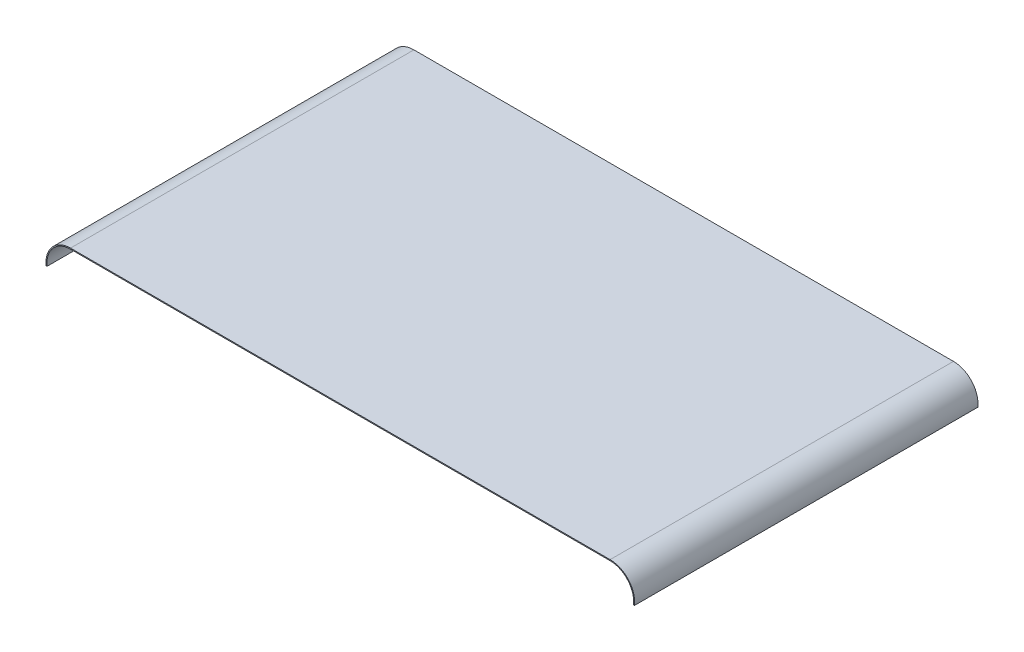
ISO-10303-21;
HEADER;
FILE_DESCRIPTION(('STEP AP214'),'2;1');
FILE_NAME('part.step','',(''),(''),'','','');
FILE_SCHEMA(('AUTOMOTIVE_DESIGN { 1 0 10303 214 1 1 1 1 }'));
ENDSEC;
DATA;
#1=APPLICATION_CONTEXT('core data for automotive mechanical design processes');
#2=APPLICATION_PROTOCOL_DEFINITION('international standard','automotive_design',2000,#1);
#3=PRODUCT_CONTEXT('',#1,'mechanical');
#4=PRODUCT('Part','Part','',(#3));
#5=PRODUCT_RELATED_PRODUCT_CATEGORY('part','',(#4));
#6=PRODUCT_DEFINITION_FORMATION('','',#4);
#7=PRODUCT_DEFINITION_CONTEXT('part definition',#1,'design');
#8=PRODUCT_DEFINITION('design','',#6,#7);
#9=PRODUCT_DEFINITION_SHAPE('','',#8);
#10=(LENGTH_UNIT() NAMED_UNIT(*) SI_UNIT(.MILLI.,.METRE.));
#11=(NAMED_UNIT(*) PLANE_ANGLE_UNIT() SI_UNIT($,.RADIAN.));
#12=(NAMED_UNIT(*) SI_UNIT($,.STERADIAN.) SOLID_ANGLE_UNIT());
#13=UNCERTAINTY_MEASURE_WITH_UNIT(LENGTH_MEASURE(1.E-05),#10,'distance_accuracy_value','');
#14=(GEOMETRIC_REPRESENTATION_CONTEXT(3) GLOBAL_UNCERTAINTY_ASSIGNED_CONTEXT((#13)) GLOBAL_UNIT_ASSIGNED_CONTEXT((#10,
#11,#12)) REPRESENTATION_CONTEXT('',''));
#15=CARTESIAN_POINT('',(0.,0.,0.));
#16=DIRECTION('',(0.,0.,1.));
#17=DIRECTION('',(1.,0.,0.));
#18=AXIS2_PLACEMENT_3D('',#15,#16,#17);
#19=CARTESIAN_POINT('',(-40.,-50.,0.));
#20=DIRECTION('',(0.,0.,-1.));
#21=DIRECTION('',(-1.,0.,0.));
#22=AXIS2_PLACEMENT_3D('',#19,#20,#21);
#23=PLANE('',#22);
#24=CARTESIAN_POINT('',(-40.,-50.,0.));
#25=DIRECTION('',(0.,0.,-1.));
#26=DIRECTION('',(-1.,0.,0.));
#27=AXIS2_PLACEMENT_3D('',#24,#25,#26);
#28=CIRCLE('',#27,48.);
#29=CARTESIAN_POINT('',(-40.,-2.,0.));
#30=VERTEX_POINT('',#29);
#31=CARTESIAN_POINT('',(-87.6309393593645,-55.9408430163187,0.));
#32=VERTEX_POINT('',#31);
#33=EDGE_CURVE('E147',#30,#32,#28,.F.);
#34=ORIENTED_EDGE('',*,*,#33,.F.);
#35=DIRECTION('',(1.,0.,0.));
#36=VECTOR('',#35,1.);
#37=CARTESIAN_POINT('',(-40.,-2.,0.));
#38=LINE('',#37,#36);
#39=CARTESIAN_POINT('',(1060.,-2.,0.));
#40=VERTEX_POINT('',#39);
#41=EDGE_CURVE('E156',#40,#30,#38,.F.);
#42=ORIENTED_EDGE('',*,*,#41,.F.);
#43=CARTESIAN_POINT('',(1060.,-50.,0.));
#44=DIRECTION('',(0.,0.,-1.));
#45=DIRECTION('',(-1.,0.,0.));
#46=AXIS2_PLACEMENT_3D('',#43,#44,#45);
#47=CIRCLE('',#46,47.9999999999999);
#48=CARTESIAN_POINT('',(1107.63093935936,-55.9408430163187,0.));
#49=VERTEX_POINT('',#48);
#50=EDGE_CURVE('E160',#49,#40,#47,.F.);
#51=ORIENTED_EDGE('',*,*,#50,.F.);
#52=DIRECTION('',(-0.992311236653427,0.123767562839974,0.));
#53=VECTOR('',#52,1.);
#54=CARTESIAN_POINT('',(1109.61556183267,-56.1883781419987,0.));
#55=LINE('',#54,#53);
#56=CARTESIAN_POINT('',(1109.61556183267,-56.1883781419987,0.));
#57=VERTEX_POINT('',#56);
#58=EDGE_CURVE('E11',#57,#49,#55,.T.);
#59=ORIENTED_EDGE('',*,*,#58,.F.);
#60=CARTESIAN_POINT('',(1060.,-50.,0.));
#61=DIRECTION('',(0.,0.,1.));
#62=DIRECTION('',(-1.,0.,0.));
#63=AXIS2_PLACEMENT_3D('',#60,#61,#62);
#64=CIRCLE('',#63,50.);
#65=CARTESIAN_POINT('',(1060.,0.,0.));
#66=VERTEX_POINT('',#65);
#67=EDGE_CURVE('E132',#57,#66,#64,.T.);
#68=ORIENTED_EDGE('',*,*,#67,.T.);
#69=DIRECTION('',(-1.,0.,0.));
#70=VECTOR('',#69,1.);
#71=CARTESIAN_POINT('',(-40.,0.,0.));
#72=LINE('',#71,#70);
#73=CARTESIAN_POINT('',(-40.,0.,0.));
#74=VERTEX_POINT('',#73);
#75=EDGE_CURVE('E133',#66,#74,#72,.T.);
#76=ORIENTED_EDGE('',*,*,#75,.T.);
#77=CARTESIAN_POINT('',(-40.,-50.,0.));
#78=DIRECTION('',(0.,0.,1.));
#79=DIRECTION('',(1.,0.,0.));
#80=AXIS2_PLACEMENT_3D('',#77,#78,#79);
#81=CIRCLE('',#80,50.);
#82=CARTESIAN_POINT('',(-89.6155618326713,-56.1883781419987,0.));
#83=VERTEX_POINT('',#82);
#84=EDGE_CURVE('E120',#74,#83,#81,.T.);
#85=ORIENTED_EDGE('',*,*,#84,.T.);
#86=DIRECTION('',(0.992311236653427,0.123767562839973,0.));
#87=VECTOR('',#86,1.);
#88=CARTESIAN_POINT('',(-89.6155618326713,-56.1883781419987,0.));
#89=LINE('',#88,#87);
#90=EDGE_CURVE('E48',#83,#32,#89,.T.);
#91=ORIENTED_EDGE('',*,*,#90,.T.);
#92=EDGE_LOOP('',(#34,#42,#51,#59,#68,#76,#85,#91));
#93=FACE_BOUND('',#92,.T.);
#94=ADVANCED_FACE('F38',(#93),#23,.F.);
#95=CARTESIAN_POINT('',(-89.6155618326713,-56.1883781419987,-350.));
#96=DIRECTION('',(-0.123767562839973,0.992311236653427,0.));
#97=DIRECTION('',(0.,0.,-1.));
#98=AXIS2_PLACEMENT_3D('',#95,#96,#97);
#99=PLANE('',#98);
#100=ORIENTED_EDGE('',*,*,#90,.F.);
#101=DIRECTION('',(0.,0.,-1.));
#102=VECTOR('',#101,1.);
#103=CARTESIAN_POINT('',(-89.6155618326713,-56.1883781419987,0.));
#104=LINE('',#103,#102);
#105=CARTESIAN_POINT('',(-89.6155618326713,-56.1883781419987,-700.));
#106=VERTEX_POINT('',#105);
#107=EDGE_CURVE('E116',#83,#106,#104,.T.);
#108=ORIENTED_EDGE('',*,*,#107,.T.);
#109=DIRECTION('',(0.992311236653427,0.123767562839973,0.));
#110=VECTOR('',#109,1.);
#111=CARTESIAN_POINT('',(-89.6155618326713,-56.1883781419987,-700.));
#112=LINE('',#111,#110);
#113=CARTESIAN_POINT('',(-87.6309393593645,-55.9408430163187,-700.));
#114=VERTEX_POINT('',#113);
#115=EDGE_CURVE('E101',#106,#114,#112,.T.);
#116=ORIENTED_EDGE('',*,*,#115,.T.);
#117=DIRECTION('',(0.,0.,-1.));
#118=VECTOR('',#117,1.);
#119=CARTESIAN_POINT('',(-87.6309393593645,-55.9408430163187,0.));
#120=LINE('',#119,#118);
#121=EDGE_CURVE('E153',#32,#114,#120,.T.);
#122=ORIENTED_EDGE('',*,*,#121,.F.);
#123=EDGE_LOOP('',(#100,#108,#116,#122));
#124=FACE_BOUND('',#123,.T.);
#125=ADVANCED_FACE('F118',(#124),#99,.F.);
#126=CARTESIAN_POINT('',(1060.,-50.,-700.));
#127=DIRECTION('',(0.,0.,-1.));
#128=DIRECTION('',(-1.,0.,0.));
#129=AXIS2_PLACEMENT_3D('',#126,#127,#128);
#130=PLANE('',#129);
#131=CARTESIAN_POINT('',(1060.,-50.,-700.));
#132=DIRECTION('',(0.,0.,-1.));
#133=DIRECTION('',(-1.,0.,0.));
#134=AXIS2_PLACEMENT_3D('',#131,#132,#133);
#135=CIRCLE('',#134,47.9999999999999);
#136=CARTESIAN_POINT('',(1107.63093935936,-55.9408430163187,-700.));
#137=VERTEX_POINT('',#136);
#138=CARTESIAN_POINT('',(1060.,-2.00000000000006,-700.));
#139=VERTEX_POINT('',#138);
#140=EDGE_CURVE('E158',#137,#139,#135,.F.);
#141=ORIENTED_EDGE('',*,*,#140,.T.);
#142=DIRECTION('',(1.,0.,0.));
#143=VECTOR('',#142,1.);
#144=CARTESIAN_POINT('',(-40.,-2.,-700.));
#145=LINE('',#144,#143);
#146=CARTESIAN_POINT('',(-40.,-2.,-700.));
#147=VERTEX_POINT('',#146);
#148=EDGE_CURVE('E151',#139,#147,#145,.F.);
#149=ORIENTED_EDGE('',*,*,#148,.T.);
#150=CARTESIAN_POINT('',(-40.,-50.,-700.));
#151=DIRECTION('',(0.,0.,-1.));
#152=DIRECTION('',(-1.,0.,0.));
#153=AXIS2_PLACEMENT_3D('',#150,#151,#152);
#154=CIRCLE('',#153,48.);
#155=EDGE_CURVE('E108',#147,#114,#154,.F.);
#156=ORIENTED_EDGE('',*,*,#155,.T.);
#157=ORIENTED_EDGE('',*,*,#115,.F.);
#158=CARTESIAN_POINT('',(-40.,-50.,-700.));
#159=DIRECTION('',(0.,0.,1.));
#160=DIRECTION('',(1.,0.,0.));
#161=AXIS2_PLACEMENT_3D('',#158,#159,#160);
#162=CIRCLE('',#161,50.);
#163=CARTESIAN_POINT('',(-40.,0.,-700.));
#164=VERTEX_POINT('',#163);
#165=EDGE_CURVE('E105',#164,#106,#162,.T.);
#166=ORIENTED_EDGE('',*,*,#165,.F.);
#167=DIRECTION('',(-1.,0.,0.));
#168=VECTOR('',#167,1.);
#169=CARTESIAN_POINT('',(-40.,0.,-700.));
#170=LINE('',#169,#168);
#171=CARTESIAN_POINT('',(1060.,0.,-700.));
#172=VERTEX_POINT('',#171);
#173=EDGE_CURVE('E119',#172,#164,#170,.T.);
#174=ORIENTED_EDGE('',*,*,#173,.F.);
#175=CARTESIAN_POINT('',(1060.,-50.,-700.));
#176=DIRECTION('',(0.,0.,1.));
#177=DIRECTION('',(-1.,0.,0.));
#178=AXIS2_PLACEMENT_3D('',#175,#176,#177);
#179=CIRCLE('',#178,50.);
#180=CARTESIAN_POINT('',(1109.61556183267,-56.1883781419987,-700.));
#181=VERTEX_POINT('',#180);
#182=EDGE_CURVE('E127',#181,#172,#179,.T.);
#183=ORIENTED_EDGE('',*,*,#182,.F.);
#184=DIRECTION('',(-0.992311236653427,0.123767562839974,0.));
#185=VECTOR('',#184,1.);
#186=CARTESIAN_POINT('',(1109.61556183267,-56.1883781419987,-700.));
#187=LINE('',#186,#185);
#188=EDGE_CURVE('E42',#181,#137,#187,.T.);
#189=ORIENTED_EDGE('',*,*,#188,.T.);
#190=EDGE_LOOP('',(#141,#149,#156,#157,#166,#174,#183,#189));
#191=FACE_BOUND('',#190,.T.);
#192=ADVANCED_FACE('F103',(#191),#130,.T.);
#193=CARTESIAN_POINT('',(1109.61556183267,-56.1883781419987,-350.));
#194=DIRECTION('',(-0.123767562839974,-0.992311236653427,0.));
#195=DIRECTION('',(0.,0.,-1.));
#196=AXIS2_PLACEMENT_3D('',#193,#194,#195);
#197=PLANE('',#196);
#198=DIRECTION('',(0.,0.,-1.));
#199=VECTOR('',#198,1.);
#200=CARTESIAN_POINT('',(1109.61556183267,-56.1883781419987,0.));
#201=LINE('',#200,#199);
#202=EDGE_CURVE('E129',#57,#181,#201,.T.);
#203=ORIENTED_EDGE('',*,*,#202,.F.);
#204=ORIENTED_EDGE('',*,*,#58,.T.);
#205=DIRECTION('',(0.,0.,-1.));
#206=VECTOR('',#205,1.);
#207=CARTESIAN_POINT('',(1107.63093935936,-55.9408430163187,0.));
#208=LINE('',#207,#206);
#209=EDGE_CURVE('E162',#49,#137,#208,.T.);
#210=ORIENTED_EDGE('',*,*,#209,.T.);
#211=ORIENTED_EDGE('',*,*,#188,.F.);
#212=EDGE_LOOP('',(#203,#204,#210,#211));
#213=FACE_BOUND('',#212,.T.);
#214=ADVANCED_FACE('F40',(#213),#197,.T.);
#215=CARTESIAN_POINT('',(1060.,-50.,0.));
#216=DIRECTION('',(0.,0.,-1.));
#217=DIRECTION('',(-1.,0.,0.));
#218=AXIS2_PLACEMENT_3D('',#215,#216,#217);
#219=CYLINDRICAL_SURFACE('',#218,47.9999999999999);
#220=ORIENTED_EDGE('',*,*,#140,.F.);
#221=ORIENTED_EDGE('',*,*,#209,.F.);
#222=ORIENTED_EDGE('',*,*,#50,.T.);
#223=DIRECTION('',(0.,0.,-1.));
#224=VECTOR('',#223,1.);
#225=CARTESIAN_POINT('',(1060.,-2.00000000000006,0.));
#226=LINE('',#225,#224);
#227=EDGE_CURVE('E159',#40,#139,#226,.T.);
#228=ORIENTED_EDGE('',*,*,#227,.T.);
#229=EDGE_LOOP('',(#220,#221,#222,#228));
#230=FACE_BOUND('',#229,.T.);
#231=ADVANCED_FACE('F178',(#230),#219,.F.);
#232=CARTESIAN_POINT('',(-40.,-2.,0.));
#233=DIRECTION('',(0.,-1.,0.));
#234=DIRECTION('',(0.,0.,-1.));
#235=AXIS2_PLACEMENT_3D('',#232,#233,#234);
#236=PLANE('',#235);
#237=ORIENTED_EDGE('',*,*,#148,.F.);
#238=ORIENTED_EDGE('',*,*,#227,.F.);
#239=ORIENTED_EDGE('',*,*,#41,.T.);
#240=DIRECTION('',(0.,0.,-1.));
#241=VECTOR('',#240,1.);
#242=CARTESIAN_POINT('',(-40.,-2.,0.));
#243=LINE('',#242,#241);
#244=EDGE_CURVE('E144',#30,#147,#243,.T.);
#245=ORIENTED_EDGE('',*,*,#244,.T.);
#246=EDGE_LOOP('',(#237,#238,#239,#245));
#247=FACE_BOUND('',#246,.T.);
#248=ADVANCED_FACE('F174',(#247),#236,.T.);
#249=CARTESIAN_POINT('',(-40.,-50.,0.));
#250=DIRECTION('',(0.,0.,-1.));
#251=DIRECTION('',(-1.,0.,0.));
#252=AXIS2_PLACEMENT_3D('',#249,#250,#251);
#253=CYLINDRICAL_SURFACE('',#252,48.);
#254=ORIENTED_EDGE('',*,*,#155,.F.);
#255=ORIENTED_EDGE('',*,*,#244,.F.);
#256=ORIENTED_EDGE('',*,*,#33,.T.);
#257=ORIENTED_EDGE('',*,*,#121,.T.);
#258=EDGE_LOOP('',(#254,#255,#256,#257));
#259=FACE_BOUND('',#258,.T.);
#260=ADVANCED_FACE('F176',(#259),#253,.F.);
#261=CARTESIAN_POINT('',(1060.,-50.,0.));
#262=DIRECTION('',(0.,0.,-1.));
#263=DIRECTION('',(-1.,0.,0.));
#264=AXIS2_PLACEMENT_3D('',#261,#262,#263);
#265=CYLINDRICAL_SURFACE('',#264,50.);
#266=ORIENTED_EDGE('',*,*,#182,.T.);
#267=DIRECTION('',(0.,0.,-1.));
#268=VECTOR('',#267,1.);
#269=CARTESIAN_POINT('',(1060.,0.,0.));
#270=LINE('',#269,#268);
#271=EDGE_CURVE('E122',#66,#172,#270,.T.);
#272=ORIENTED_EDGE('',*,*,#271,.F.);
#273=ORIENTED_EDGE('',*,*,#67,.F.);
#274=ORIENTED_EDGE('',*,*,#202,.T.);
#275=EDGE_LOOP('',(#266,#272,#273,#274));
#276=FACE_BOUND('',#275,.T.);
#277=ADVANCED_FACE('F194',(#276),#265,.T.);
#278=CARTESIAN_POINT('',(-40.,0.,0.));
#279=DIRECTION('',(0.,-1.,0.));
#280=DIRECTION('',(0.,0.,-1.));
#281=AXIS2_PLACEMENT_3D('',#278,#279,#280);
#282=PLANE('',#281);
#283=ORIENTED_EDGE('',*,*,#173,.T.);
#284=DIRECTION('',(0.,0.,-1.));
#285=VECTOR('',#284,1.);
#286=CARTESIAN_POINT('',(-40.,0.,0.));
#287=LINE('',#286,#285);
#288=EDGE_CURVE('E94',#74,#164,#287,.T.);
#289=ORIENTED_EDGE('',*,*,#288,.F.);
#290=ORIENTED_EDGE('',*,*,#75,.F.);
#291=ORIENTED_EDGE('',*,*,#271,.T.);
#292=EDGE_LOOP('',(#283,#289,#290,#291));
#293=FACE_BOUND('',#292,.T.);
#294=ADVANCED_FACE('F197',(#293),#282,.F.);
#295=CARTESIAN_POINT('',(-40.,-50.,0.));
#296=DIRECTION('',(0.,0.,-1.));
#297=DIRECTION('',(-1.,0.,0.));
#298=AXIS2_PLACEMENT_3D('',#295,#296,#297);
#299=CYLINDRICAL_SURFACE('',#298,50.);
#300=ORIENTED_EDGE('',*,*,#165,.T.);
#301=ORIENTED_EDGE('',*,*,#107,.F.);
#302=ORIENTED_EDGE('',*,*,#84,.F.);
#303=ORIENTED_EDGE('',*,*,#288,.T.);
#304=EDGE_LOOP('',(#300,#301,#302,#303));
#305=FACE_BOUND('',#304,.T.);
#306=ADVANCED_FACE('F115',(#305),#299,.T.);
#307=CLOSED_SHELL('',(#94,#125,#192,#214,#231,#248,#260,#277,#294,#306));
#308=MANIFOLD_SOLID_BREP('B2',#307);
#309=ADVANCED_BREP_SHAPE_REPRESENTATION('',(#18,#308),#14);
#310=SHAPE_DEFINITION_REPRESENTATION(#9,#309);
ENDSEC;
END-ISO-10303-21;
